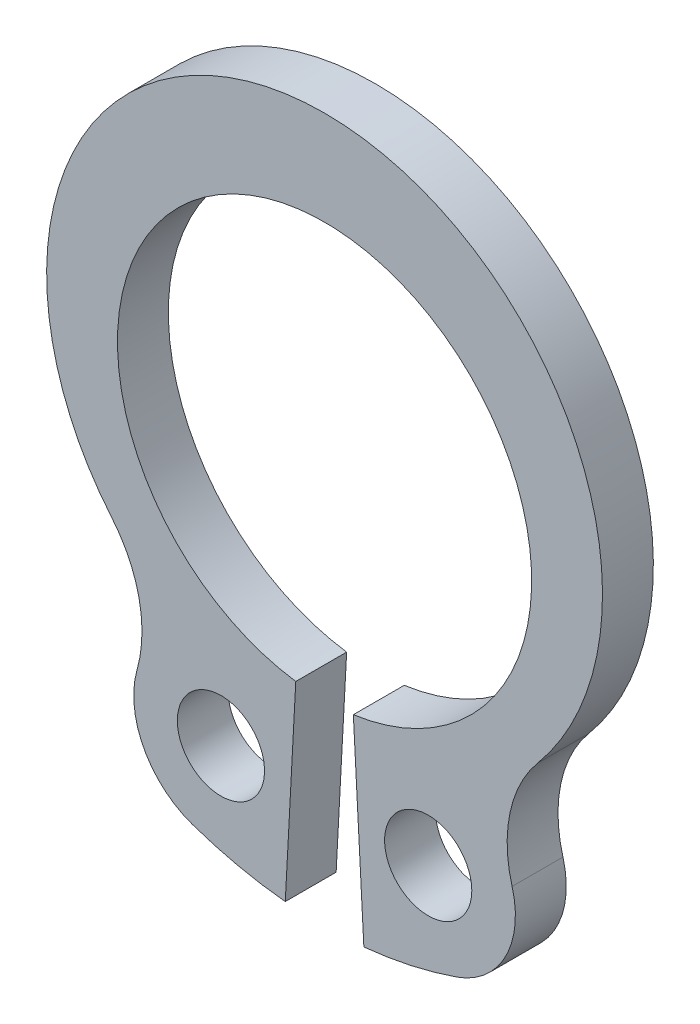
from build123d import *

# Parameters (mm, degrees)
ESQUISSE1_R          = 0.6
BASE_EXTRUSION_DEPTH = 0.7


with BuildPart() as part:
    # Esquisse1 → Base-Extrusion (new body)
    with BuildSketch(Plane.XY):
        with BuildLine():
            Line((0.396088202, -2.822341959), (0.540766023, -5.518462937))
            ThreePointArc((0.540766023, -5.518462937), (1.188786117, -5.415962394), (1.820163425, -5.237639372))
            ThreePointArc((1.820163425, -5.237639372), (2.490578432, -4.658399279), (2.580806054, -3.777017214))
            ThreePointArc((2.580806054, -3.777017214), (2.552375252, -2.910204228), (2.932592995, -2.130712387))
            ThreePointArc((2.932592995, -2.130712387), (0, 4.15), (-2.932592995, -2.130712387))
            ThreePointArc((-2.932592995, -2.130712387), (-2.552375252, -2.910204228), (-2.580806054, -3.777017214))
            ThreePointArc((-2.580806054, -3.777017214), (-2.490578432, -4.658399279), (-1.820163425, -5.237639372))
            ThreePointArc((-1.820163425, -5.237639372), (-1.188786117, -5.415962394), (-0.540766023, -5.518462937))
            Line((-0.540766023, -5.518462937), (-0.396088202, -2.822341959))
            ThreePointArc((-0.396088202, -2.822341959), (0, 2.85), (0.396088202, -2.822341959))
        make_face()
        with Locations((1.426252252, -4.104134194)):
            Circle(ESQUISSE1_R, mode=Mode.SUBTRACT)
        with Locations(Location((-1.426252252, -4.104134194, 0), (0, 0, 180))):
            Circle(ESQUISSE1_R, mode=Mode.SUBTRACT)
    extrude(amount=BASE_EXTRUSION_DEPTH)


solid = part.part
